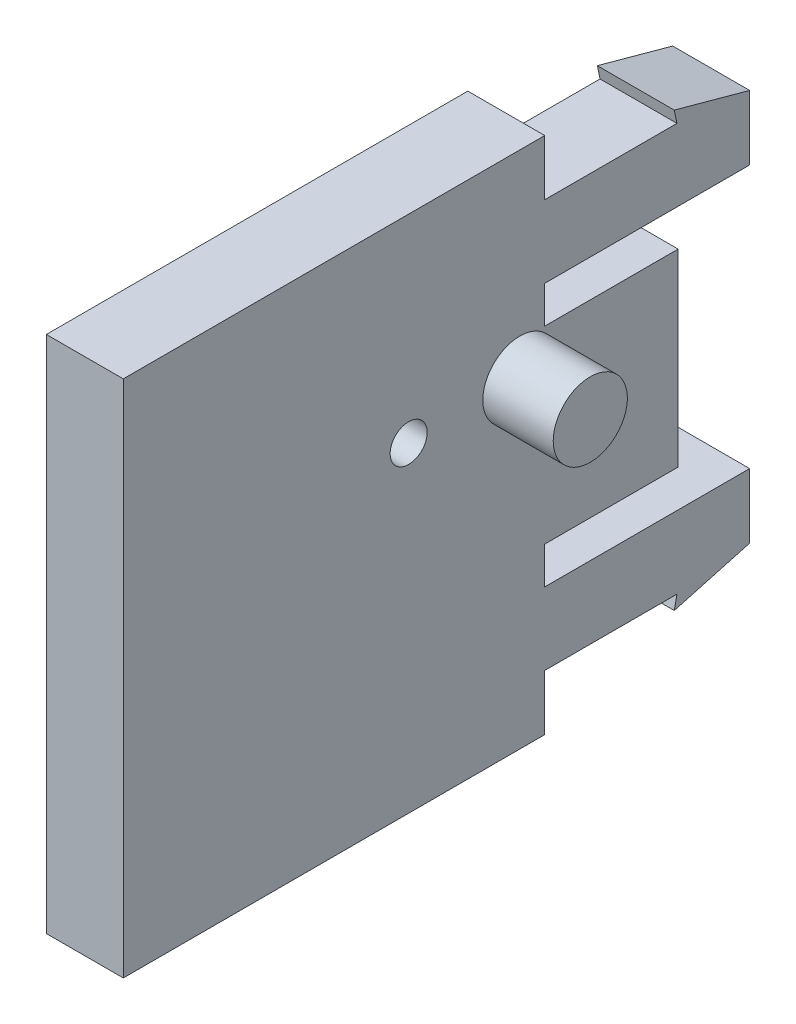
ISO-10303-21;
HEADER;
FILE_DESCRIPTION(('STEP AP214'),'2;1');
FILE_NAME('part.step','',(''),(''),'','','');
FILE_SCHEMA(('AUTOMOTIVE_DESIGN { 1 0 10303 214 1 1 1 1 }'));
ENDSEC;
DATA;
#1=APPLICATION_CONTEXT('core data for automotive mechanical design processes');
#2=APPLICATION_PROTOCOL_DEFINITION('international standard','automotive_design',2000,#1);
#3=PRODUCT_CONTEXT('',#1,'mechanical');
#4=PRODUCT('Part','Part','',(#3));
#5=PRODUCT_RELATED_PRODUCT_CATEGORY('part','',(#4));
#6=PRODUCT_DEFINITION_FORMATION('','',#4);
#7=PRODUCT_DEFINITION_CONTEXT('part definition',#1,'design');
#8=PRODUCT_DEFINITION('design','',#6,#7);
#9=PRODUCT_DEFINITION_SHAPE('','',#8);
#10=(LENGTH_UNIT() NAMED_UNIT(*) SI_UNIT(.MILLI.,.METRE.));
#11=(NAMED_UNIT(*) PLANE_ANGLE_UNIT() SI_UNIT($,.RADIAN.));
#12=(NAMED_UNIT(*) SI_UNIT($,.STERADIAN.) SOLID_ANGLE_UNIT());
#13=UNCERTAINTY_MEASURE_WITH_UNIT(LENGTH_MEASURE(1.E-05),#10,'distance_accuracy_value','');
#14=(GEOMETRIC_REPRESENTATION_CONTEXT(3) GLOBAL_UNCERTAINTY_ASSIGNED_CONTEXT((#13)) GLOBAL_UNIT_ASSIGNED_CONTEXT((#10,
#11,#12)) REPRESENTATION_CONTEXT('',''));
#15=CARTESIAN_POINT('',(0.,0.,0.));
#16=DIRECTION('',(0.,0.,1.));
#17=DIRECTION('',(1.,0.,0.));
#18=AXIS2_PLACEMENT_3D('',#15,#16,#17);
#19=CARTESIAN_POINT('',(5.35307921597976,47.2495708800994,15.));
#20=DIRECTION('',(1.,0.,0.));
#21=DIRECTION('',(0.,0.,-1.));
#22=AXIS2_PLACEMENT_3D('',#19,#20,#21);
#23=PLANE('',#22);
#24=CARTESIAN_POINT('',(5.35307921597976,55.9995709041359,9.1));
#25=DIRECTION('',(-1.,0.,0.));
#26=DIRECTION('',(0.,0.,1.));
#27=AXIS2_PLACEMENT_3D('',#24,#25,#26);
#28=CIRCLE('',#27,0.500000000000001);
#29=CARTESIAN_POINT('',(5.35307921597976,55.9995709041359,9.6));
#30=VERTEX_POINT('',#29);
#31=EDGE_CURVE('E382',#30,#30,#28,.T.);
#32=ORIENTED_EDGE('',*,*,#31,.F.);
#33=EDGE_LOOP('',(#32));
#34=FACE_BOUND('',#33,.T.);
#35=DIRECTION('',(0.,0.,1.));
#36=VECTOR('',#35,1.);
#37=CARTESIAN_POINT('',(5.35307921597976,48.7495708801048,3.62857844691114));
#38=LINE('',#37,#36);
#39=CARTESIAN_POINT('',(5.35307921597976,48.7495708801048,0.0612701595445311));
#40=VERTEX_POINT('',#39);
#41=CARTESIAN_POINT('',(5.35307921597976,48.7495708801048,3.62857844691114));
#42=VERTEX_POINT('',#41);
#43=EDGE_CURVE('E251',#40,#42,#38,.T.);
#44=ORIENTED_EDGE('',*,*,#43,.T.);
#45=DIRECTION('',(0.,-1.,0.));
#46=VECTOR('',#45,1.);
#47=CARTESIAN_POINT('',(5.35307921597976,48.7495708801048,3.62857844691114));
#48=LINE('',#47,#46);
#49=CARTESIAN_POINT('',(5.35307921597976,47.2495708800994,3.62857844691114));
#50=VERTEX_POINT('',#49);
#51=EDGE_CURVE('E174',#42,#50,#48,.T.);
#52=ORIENTED_EDGE('',*,*,#51,.T.);
#53=DIRECTION('',(0.,0.,-1.));
#54=VECTOR('',#53,1.);
#55=CARTESIAN_POINT('',(5.35307921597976,47.2495708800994,15.));
#56=LINE('',#55,#54);
#57=CARTESIAN_POINT('',(5.35307921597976,47.2495708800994,15.));
#58=VERTEX_POINT('',#57);
#59=EDGE_CURVE('E194',#58,#50,#56,.T.);
#60=ORIENTED_EDGE('',*,*,#59,.F.);
#61=DIRECTION('',(0.,-1.,0.));
#62=VECTOR('',#61,1.);
#63=CARTESIAN_POINT('',(5.35307921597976,47.2495708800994,15.));
#64=LINE('',#63,#62);
#65=CARTESIAN_POINT('',(5.35307921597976,61.2495708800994,15.));
#66=VERTEX_POINT('',#65);
#67=EDGE_CURVE('E247',#66,#58,#64,.T.);
#68=ORIENTED_EDGE('',*,*,#67,.F.);
#69=DIRECTION('',(0.,0.,-1.));
#70=VECTOR('',#69,1.);
#71=CARTESIAN_POINT('',(5.35307921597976,61.2495708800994,15.));
#72=LINE('',#71,#70);
#73=CARTESIAN_POINT('',(5.35307921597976,61.2495708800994,3.62857844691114));
#74=VERTEX_POINT('',#73);
#75=EDGE_CURVE('E192',#66,#74,#72,.T.);
#76=ORIENTED_EDGE('',*,*,#75,.T.);
#77=DIRECTION('',(0.,-1.,0.));
#78=VECTOR('',#77,1.);
#79=CARTESIAN_POINT('',(5.35307921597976,59.7495708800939,3.62857844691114));
#80=LINE('',#79,#78);
#81=CARTESIAN_POINT('',(5.35307921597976,59.7495708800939,3.62857844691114));
#82=VERTEX_POINT('',#81);
#83=EDGE_CURVE('E168',#74,#82,#80,.T.);
#84=ORIENTED_EDGE('',*,*,#83,.T.);
#85=DIRECTION('',(0.,0.,-1.));
#86=VECTOR('',#85,1.);
#87=CARTESIAN_POINT('',(5.35307921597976,59.7495708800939,3.62857844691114));
#88=LINE('',#87,#86);
#89=CARTESIAN_POINT('',(5.35307921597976,59.7495708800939,0.0612701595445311));
#90=VERTEX_POINT('',#89);
#91=EDGE_CURVE('E299',#82,#90,#88,.T.);
#92=ORIENTED_EDGE('',*,*,#91,.T.);
#93=DIRECTION('',(0.,0.978799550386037,0.204820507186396));
#94=VECTOR('',#93,1.);
#95=CARTESIAN_POINT('',(5.35307921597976,59.7495708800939,0.0612701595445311));
#96=LINE('',#95,#94);
#97=CARTESIAN_POINT('',(5.35307921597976,60.096272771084,0.133819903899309));
#98=VERTEX_POINT('',#97);
#99=EDGE_CURVE('E302',#90,#98,#96,.T.);
#100=ORIENTED_EDGE('',*,*,#99,.T.);
#101=DIRECTION('',(0.,-0.264145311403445,-0.964482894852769));
#102=VECTOR('',#101,1.);
#103=CARTESIAN_POINT('',(5.35307921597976,60.096272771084,0.133819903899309));
#104=LINE('',#103,#102);
#105=CARTESIAN_POINT('',(5.35307921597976,59.5392654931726,-1.9));
#106=VERTEX_POINT('',#105);
#107=EDGE_CURVE('E309',#98,#106,#104,.T.);
#108=ORIENTED_EDGE('',*,*,#107,.T.);
#109=DIRECTION('',(0.,-1.,0.));
#110=VECTOR('',#109,1.);
#111=CARTESIAN_POINT('',(5.35307921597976,47.2495708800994,-1.9));
#112=LINE('',#111,#110);
#113=CARTESIAN_POINT('',(5.35307921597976,57.796272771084,-1.9));
#114=VERTEX_POINT('',#113);
#115=EDGE_CURVE('E287',#106,#114,#112,.T.);
#116=ORIENTED_EDGE('',*,*,#115,.T.);
#117=DIRECTION('',(0.,0.,1.));
#118=VECTOR('',#117,1.);
#119=CARTESIAN_POINT('',(5.35307921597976,57.796272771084,3.62857844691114));
#120=LINE('',#119,#118);
#121=CARTESIAN_POINT('',(5.35307921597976,57.796272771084,3.62857844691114));
#122=VERTEX_POINT('',#121);
#123=EDGE_CURVE('E312',#114,#122,#120,.T.);
#124=ORIENTED_EDGE('',*,*,#123,.T.);
#125=DIRECTION('',(0.,-1.,0.));
#126=VECTOR('',#125,1.);
#127=CARTESIAN_POINT('',(5.35307921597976,57.796272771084,3.62857844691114));
#128=LINE('',#127,#126);
#129=CARTESIAN_POINT('',(5.35307921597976,56.796272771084,3.62857844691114));
#130=VERTEX_POINT('',#129);
#131=EDGE_CURVE('E315',#122,#130,#128,.T.);
#132=ORIENTED_EDGE('',*,*,#131,.T.);
#133=DIRECTION('',(0.,0.,-1.));
#134=VECTOR('',#133,1.);
#135=CARTESIAN_POINT('',(5.35307921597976,56.796272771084,3.62857844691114));
#136=LINE('',#135,#134);
#137=CARTESIAN_POINT('',(5.35307921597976,56.796272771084,0.0285784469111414));
#138=VERTEX_POINT('',#137);
#139=EDGE_CURVE('E318',#130,#138,#136,.T.);
#140=ORIENTED_EDGE('',*,*,#139,.T.);
#141=DIRECTION('',(0.,-1.,0.));
#142=VECTOR('',#141,1.);
#143=CARTESIAN_POINT('',(5.35307921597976,56.796272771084,0.0285784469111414));
#144=LINE('',#143,#142);
#145=CARTESIAN_POINT('',(5.35307921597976,51.7028689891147,0.0285784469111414));
#146=VERTEX_POINT('',#145);
#147=EDGE_CURVE('E321',#138,#146,#144,.T.);
#148=ORIENTED_EDGE('',*,*,#147,.T.);
#149=DIRECTION('',(0.,0.,1.));
#150=VECTOR('',#149,1.);
#151=CARTESIAN_POINT('',(5.35307921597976,51.7028689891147,3.62857844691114));
#152=LINE('',#151,#150);
#153=CARTESIAN_POINT('',(5.35307921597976,51.7028689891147,3.62857844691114));
#154=VERTEX_POINT('',#153);
#155=EDGE_CURVE('E324',#146,#154,#152,.T.);
#156=ORIENTED_EDGE('',*,*,#155,.T.);
#157=DIRECTION('',(0.,-1.,0.));
#158=VECTOR('',#157,1.);
#159=CARTESIAN_POINT('',(5.35307921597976,50.7028689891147,3.62857844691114));
#160=LINE('',#159,#158);
#161=CARTESIAN_POINT('',(5.35307921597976,50.7028689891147,3.62857844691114));
#162=VERTEX_POINT('',#161);
#163=EDGE_CURVE('E327',#154,#162,#160,.T.);
#164=ORIENTED_EDGE('',*,*,#163,.T.);
#165=DIRECTION('',(0.,0.,-1.));
#166=VECTOR('',#165,1.);
#167=CARTESIAN_POINT('',(5.35307921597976,50.7028689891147,3.62857844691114));
#168=LINE('',#167,#166);
#169=CARTESIAN_POINT('',(5.35307921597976,50.7028689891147,-1.9));
#170=VERTEX_POINT('',#169);
#171=EDGE_CURVE('E330',#162,#170,#168,.T.);
#172=ORIENTED_EDGE('',*,*,#171,.T.);
#173=CARTESIAN_POINT('',(5.35307921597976,48.9598762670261,-1.9));
#174=VERTEX_POINT('',#173);
#175=EDGE_CURVE('E259',#170,#174,#112,.T.);
#176=ORIENTED_EDGE('',*,*,#175,.T.);
#177=DIRECTION('',(0.,-0.264145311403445,0.964482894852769));
#178=VECTOR('',#177,1.);
#179=CARTESIAN_POINT('',(5.35307921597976,48.4028689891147,0.133819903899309));
#180=LINE('',#179,#178);
#181=CARTESIAN_POINT('',(5.35307921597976,48.4028689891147,0.133819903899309));
#182=VERTEX_POINT('',#181);
#183=EDGE_CURVE('E48',#174,#182,#180,.T.);
#184=ORIENTED_EDGE('',*,*,#183,.T.);
#185=DIRECTION('',(0.,0.978799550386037,-0.204820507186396));
#186=VECTOR('',#185,1.);
#187=CARTESIAN_POINT('',(5.35307921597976,48.7495708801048,0.0612701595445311));
#188=LINE('',#187,#186);
#189=EDGE_CURVE('E254',#182,#40,#188,.T.);
#190=ORIENTED_EDGE('',*,*,#189,.T.);
#191=EDGE_LOOP('',(#44,#52,#60,#68,#76,#84,#92,#100,#108,#116,#124,#132,#140,#148,#156,#164,
#172,#176,#184,#190));
#192=FACE_BOUND('',#191,.T.);
#193=CARTESIAN_POINT('',(5.35307921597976,55.9995708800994,12.1));
#194=DIRECTION('',(1.,0.,0.));
#195=DIRECTION('',(0.,0.,-1.));
#196=AXIS2_PLACEMENT_3D('',#193,#194,#195);
#197=CIRCLE('',#196,1.);
#198=CARTESIAN_POINT('',(5.35307921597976,55.9995708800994,11.1));
#199=VERTEX_POINT('',#198);
#200=EDGE_CURVE('E11',#199,#199,#197,.F.);
#201=ORIENTED_EDGE('',*,*,#200,.F.);
#202=EDGE_LOOP('',(#201));
#203=FACE_BOUND('',#202,.T.);
#204=ADVANCED_FACE('F26',(#34,#192,#203),#23,.F.);
#205=CARTESIAN_POINT('',(7.42876299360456,47.2495708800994,15.));
#206=DIRECTION('',(-1.,0.,0.));
#207=DIRECTION('',(0.,0.,1.));
#208=AXIS2_PLACEMENT_3D('',#205,#206,#207);
#209=PLANE('',#208);
#210=CARTESIAN_POINT('',(7.42876299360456,55.8995709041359,7.3));
#211=DIRECTION('',(1.,0.,0.));
#212=DIRECTION('',(0.,0.,-1.));
#213=AXIS2_PLACEMENT_3D('',#210,#211,#212);
#214=CIRCLE('',#213,0.500000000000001);
#215=CARTESIAN_POINT('',(7.42876299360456,55.8995709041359,6.8));
#216=VERTEX_POINT('',#215);
#217=EDGE_CURVE('E388',#216,#216,#214,.T.);
#218=ORIENTED_EDGE('',*,*,#217,.F.);
#219=EDGE_LOOP('',(#218));
#220=FACE_BOUND('',#219,.T.);
#221=DIRECTION('',(0.,0.,-1.));
#222=VECTOR('',#221,1.);
#223=CARTESIAN_POINT('',(7.42876299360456,47.2495708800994,15.));
#224=LINE('',#223,#222);
#225=CARTESIAN_POINT('',(7.42876299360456,47.2495708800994,15.));
#226=VERTEX_POINT('',#225);
#227=CARTESIAN_POINT('',(7.42876299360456,47.2495708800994,3.62857844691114));
#228=VERTEX_POINT('',#227);
#229=EDGE_CURVE('E191',#226,#228,#224,.T.);
#230=ORIENTED_EDGE('',*,*,#229,.T.);
#231=DIRECTION('',(0.,-1.,0.));
#232=VECTOR('',#231,1.);
#233=CARTESIAN_POINT('',(7.42876299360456,48.7495708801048,3.62857844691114));
#234=LINE('',#233,#232);
#235=CARTESIAN_POINT('',(7.42876299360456,48.7495708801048,3.62857844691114));
#236=VERTEX_POINT('',#235);
#237=EDGE_CURVE('E300',#236,#228,#234,.T.);
#238=ORIENTED_EDGE('',*,*,#237,.F.);
#239=DIRECTION('',(0.,0.,1.));
#240=VECTOR('',#239,1.);
#241=CARTESIAN_POINT('',(7.42876299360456,48.7495708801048,3.62857844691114));
#242=LINE('',#241,#240);
#243=CARTESIAN_POINT('',(7.42876299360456,48.7495708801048,0.0612701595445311));
#244=VERTEX_POINT('',#243);
#245=EDGE_CURVE('E304',#244,#236,#242,.T.);
#246=ORIENTED_EDGE('',*,*,#245,.F.);
#247=DIRECTION('',(0.,0.978799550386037,-0.204820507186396));
#248=VECTOR('',#247,1.);
#249=CARTESIAN_POINT('',(7.42876299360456,48.7495708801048,0.0612701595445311));
#250=LINE('',#249,#248);
#251=CARTESIAN_POINT('',(7.42876299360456,48.4028689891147,0.133819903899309));
#252=VERTEX_POINT('',#251);
#253=EDGE_CURVE('E338',#252,#244,#250,.T.);
#254=ORIENTED_EDGE('',*,*,#253,.F.);
#255=DIRECTION('',(0.,-0.264145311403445,0.964482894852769));
#256=VECTOR('',#255,1.);
#257=CARTESIAN_POINT('',(7.42876299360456,48.4028689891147,0.133819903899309));
#258=LINE('',#257,#256);
#259=CARTESIAN_POINT('',(7.42876299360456,48.9598762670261,-1.9));
#260=VERTEX_POINT('',#259);
#261=EDGE_CURVE('E346',#260,#252,#258,.T.);
#262=ORIENTED_EDGE('',*,*,#261,.F.);
#263=DIRECTION('',(0.,1.,0.));
#264=VECTOR('',#263,1.);
#265=CARTESIAN_POINT('',(7.42876299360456,47.2495708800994,-1.9));
#266=LINE('',#265,#264);
#267=CARTESIAN_POINT('',(7.42876299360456,50.7028689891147,-1.9));
#268=VERTEX_POINT('',#267);
#269=EDGE_CURVE('E291',#260,#268,#266,.T.);
#270=ORIENTED_EDGE('',*,*,#269,.T.);
#271=DIRECTION('',(0.,0.,-1.));
#272=VECTOR('',#271,1.);
#273=CARTESIAN_POINT('',(7.42876299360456,50.7028689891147,3.62857844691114));
#274=LINE('',#273,#272);
#275=CARTESIAN_POINT('',(7.42876299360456,50.7028689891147,3.62857844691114));
#276=VERTEX_POINT('',#275);
#277=EDGE_CURVE('E350',#276,#268,#274,.T.);
#278=ORIENTED_EDGE('',*,*,#277,.F.);
#279=DIRECTION('',(0.,-1.,0.));
#280=VECTOR('',#279,1.);
#281=CARTESIAN_POINT('',(7.42876299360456,50.7028689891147,3.62857844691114));
#282=LINE('',#281,#280);
#283=CARTESIAN_POINT('',(7.42876299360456,51.7028689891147,3.62857844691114));
#284=VERTEX_POINT('',#283);
#285=EDGE_CURVE('E352',#284,#276,#282,.T.);
#286=ORIENTED_EDGE('',*,*,#285,.F.);
#287=DIRECTION('',(0.,0.,1.));
#288=VECTOR('',#287,1.);
#289=CARTESIAN_POINT('',(7.42876299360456,51.7028689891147,3.62857844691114));
#290=LINE('',#289,#288);
#291=CARTESIAN_POINT('',(7.42876299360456,51.7028689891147,0.0285784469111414));
#292=VERTEX_POINT('',#291);
#293=EDGE_CURVE('E355',#292,#284,#290,.T.);
#294=ORIENTED_EDGE('',*,*,#293,.F.);
#295=DIRECTION('',(0.,-1.,0.));
#296=VECTOR('',#295,1.);
#297=CARTESIAN_POINT('',(7.42876299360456,56.796272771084,0.0285784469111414));
#298=LINE('',#297,#296);
#299=CARTESIAN_POINT('',(7.42876299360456,56.796272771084,0.0285784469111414));
#300=VERTEX_POINT('',#299);
#301=EDGE_CURVE('E358',#300,#292,#298,.T.);
#302=ORIENTED_EDGE('',*,*,#301,.F.);
#303=DIRECTION('',(0.,0.,-1.));
#304=VECTOR('',#303,1.);
#305=CARTESIAN_POINT('',(7.42876299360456,56.796272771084,3.62857844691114));
#306=LINE('',#305,#304);
#307=CARTESIAN_POINT('',(7.42876299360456,56.796272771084,3.62857844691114));
#308=VERTEX_POINT('',#307);
#309=EDGE_CURVE('E361',#308,#300,#306,.T.);
#310=ORIENTED_EDGE('',*,*,#309,.F.);
#311=DIRECTION('',(0.,-1.,0.));
#312=VECTOR('',#311,1.);
#313=CARTESIAN_POINT('',(7.42876299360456,57.796272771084,3.62857844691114));
#314=LINE('',#313,#312);
#315=CARTESIAN_POINT('',(7.42876299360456,57.796272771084,3.62857844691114));
#316=VERTEX_POINT('',#315);
#317=EDGE_CURVE('E364',#316,#308,#314,.T.);
#318=ORIENTED_EDGE('',*,*,#317,.F.);
#319=DIRECTION('',(0.,0.,1.));
#320=VECTOR('',#319,1.);
#321=CARTESIAN_POINT('',(7.42876299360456,57.796272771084,3.62857844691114));
#322=LINE('',#321,#320);
#323=CARTESIAN_POINT('',(7.42876299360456,57.796272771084,-1.9));
#324=VERTEX_POINT('',#323);
#325=EDGE_CURVE('E367',#324,#316,#322,.T.);
#326=ORIENTED_EDGE('',*,*,#325,.F.);
#327=CARTESIAN_POINT('',(7.42876299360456,59.5392654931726,-1.9));
#328=VERTEX_POINT('',#327);
#329=EDGE_CURVE('E288',#324,#328,#266,.T.);
#330=ORIENTED_EDGE('',*,*,#329,.T.);
#331=DIRECTION('',(0.,-0.264145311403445,-0.964482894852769));
#332=VECTOR('',#331,1.);
#333=CARTESIAN_POINT('',(7.42876299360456,60.096272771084,0.133819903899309));
#334=LINE('',#333,#332);
#335=CARTESIAN_POINT('',(7.42876299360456,60.096272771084,0.133819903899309));
#336=VERTEX_POINT('',#335);
#337=EDGE_CURVE('E40',#336,#328,#334,.T.);
#338=ORIENTED_EDGE('',*,*,#337,.F.);
#339=DIRECTION('',(0.,0.978799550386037,0.204820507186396));
#340=VECTOR('',#339,1.);
#341=CARTESIAN_POINT('',(7.42876299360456,59.7495708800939,0.0612701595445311));
#342=LINE('',#341,#340);
#343=CARTESIAN_POINT('',(7.42876299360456,59.7495708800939,0.0612701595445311));
#344=VERTEX_POINT('',#343);
#345=EDGE_CURVE('E370',#344,#336,#342,.T.);
#346=ORIENTED_EDGE('',*,*,#345,.F.);
#347=DIRECTION('',(0.,0.,-1.));
#348=VECTOR('',#347,1.);
#349=CARTESIAN_POINT('',(7.42876299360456,59.7495708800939,3.62857844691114));
#350=LINE('',#349,#348);
#351=CARTESIAN_POINT('',(7.42876299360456,59.7495708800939,3.62857844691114));
#352=VERTEX_POINT('',#351);
#353=EDGE_CURVE('E186',#352,#344,#350,.T.);
#354=ORIENTED_EDGE('',*,*,#353,.F.);
#355=DIRECTION('',(0.,-1.,0.));
#356=VECTOR('',#355,1.);
#357=CARTESIAN_POINT('',(7.42876299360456,59.7495708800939,3.62857844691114));
#358=LINE('',#357,#356);
#359=CARTESIAN_POINT('',(7.42876299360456,61.2495708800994,3.62857844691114));
#360=VERTEX_POINT('',#359);
#361=EDGE_CURVE('E165',#360,#352,#358,.T.);
#362=ORIENTED_EDGE('',*,*,#361,.F.);
#363=DIRECTION('',(0.,0.,-1.));
#364=VECTOR('',#363,1.);
#365=CARTESIAN_POINT('',(7.42876299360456,61.2495708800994,15.));
#366=LINE('',#365,#364);
#367=CARTESIAN_POINT('',(7.42876299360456,61.2495708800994,15.));
#368=VERTEX_POINT('',#367);
#369=EDGE_CURVE('E182',#368,#360,#366,.T.);
#370=ORIENTED_EDGE('',*,*,#369,.F.);
#371=DIRECTION('',(0.,1.,0.));
#372=VECTOR('',#371,1.);
#373=CARTESIAN_POINT('',(7.42876299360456,47.2495708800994,15.));
#374=LINE('',#373,#372);
#375=EDGE_CURVE('E294',#226,#368,#374,.T.);
#376=ORIENTED_EDGE('',*,*,#375,.F.);
#377=EDGE_LOOP('',(#230,#238,#246,#254,#262,#270,#278,#286,#294,#302,#310,#318,#326,#330,#338,
#346,#354,#362,#370,#376));
#378=FACE_BOUND('',#377,.T.);
#379=CARTESIAN_POINT('',(7.42876299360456,55.8995708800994,4.3));
#380=DIRECTION('',(-1.,0.,0.));
#381=DIRECTION('',(0.,0.,1.));
#382=AXIS2_PLACEMENT_3D('',#379,#380,#381);
#383=CIRCLE('',#382,1.);
#384=CARTESIAN_POINT('',(7.42876299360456,55.8995708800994,5.3));
#385=VERTEX_POINT('',#384);
#386=EDGE_CURVE('E33',#385,#385,#383,.F.);
#387=ORIENTED_EDGE('',*,*,#386,.F.);
#388=EDGE_LOOP('',(#387));
#389=FACE_BOUND('',#388,.T.);
#390=ADVANCED_FACE('F179',(#220,#378,#389),#209,.F.);
#391=CARTESIAN_POINT('',(5.35307921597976,61.2495708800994,-1.9));
#392=DIRECTION('',(0.,0.,-1.));
#393=DIRECTION('',(-1.,0.,0.));
#394=AXIS2_PLACEMENT_3D('',#391,#392,#393);
#395=PLANE('',#394);
#396=DIRECTION('',(1.,0.,0.));
#397=VECTOR('',#396,1.);
#398=CARTESIAN_POINT('',(5.35307921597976,48.9598762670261,-1.9));
#399=LINE('',#398,#397);
#400=EDGE_CURVE('E207',#174,#260,#399,.T.);
#401=ORIENTED_EDGE('',*,*,#400,.F.);
#402=ORIENTED_EDGE('',*,*,#175,.F.);
#403=DIRECTION('',(-1.,0.,0.));
#404=VECTOR('',#403,1.);
#405=CARTESIAN_POINT('',(5.35307921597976,50.7028689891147,-1.9));
#406=LINE('',#405,#404);
#407=EDGE_CURVE('E205',#268,#170,#406,.T.);
#408=ORIENTED_EDGE('',*,*,#407,.F.);
#409=ORIENTED_EDGE('',*,*,#269,.F.);
#410=EDGE_LOOP('',(#401,#402,#408,#409));
#411=FACE_BOUND('',#410,.T.);
#412=ADVANCED_FACE('F213',(#411),#395,.T.);
#413=CARTESIAN_POINT('',(5.35307921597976,47.2495708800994,15.));
#414=DIRECTION('',(0.,1.,0.));
#415=DIRECTION('',(0.,0.,1.));
#416=AXIS2_PLACEMENT_3D('',#413,#414,#415);
#417=PLANE('',#416);
#418=ORIENTED_EDGE('',*,*,#59,.T.);
#419=DIRECTION('',(1.,0.,0.));
#420=VECTOR('',#419,1.);
#421=CARTESIAN_POINT('',(5.35307921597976,47.2495708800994,3.62857844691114));
#422=LINE('',#421,#420);
#423=EDGE_CURVE('E239',#50,#228,#422,.T.);
#424=ORIENTED_EDGE('',*,*,#423,.T.);
#425=ORIENTED_EDGE('',*,*,#229,.F.);
#426=DIRECTION('',(1.,0.,0.));
#427=VECTOR('',#426,1.);
#428=CARTESIAN_POINT('',(5.35307921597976,47.2495708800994,15.));
#429=LINE('',#428,#427);
#430=EDGE_CURVE('E240',#58,#226,#429,.T.);
#431=ORIENTED_EDGE('',*,*,#430,.F.);
#432=EDGE_LOOP('',(#418,#424,#425,#431));
#433=FACE_BOUND('',#432,.T.);
#434=ADVANCED_FACE('F221',(#433),#417,.F.);
#435=CARTESIAN_POINT('',(5.35307921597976,61.2495708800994,15.));
#436=DIRECTION('',(0.,-1.,0.));
#437=DIRECTION('',(0.,0.,-1.));
#438=AXIS2_PLACEMENT_3D('',#435,#436,#437);
#439=PLANE('',#438);
#440=ORIENTED_EDGE('',*,*,#369,.T.);
#441=DIRECTION('',(1.,0.,0.));
#442=VECTOR('',#441,1.);
#443=CARTESIAN_POINT('',(5.35307921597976,61.2495708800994,3.62857844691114));
#444=LINE('',#443,#442);
#445=EDGE_CURVE('E162',#74,#360,#444,.T.);
#446=ORIENTED_EDGE('',*,*,#445,.F.);
#447=ORIENTED_EDGE('',*,*,#75,.F.);
#448=DIRECTION('',(-1.,0.,0.));
#449=VECTOR('',#448,1.);
#450=CARTESIAN_POINT('',(5.35307921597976,61.2495708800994,15.));
#451=LINE('',#450,#449);
#452=EDGE_CURVE('E190',#368,#66,#451,.T.);
#453=ORIENTED_EDGE('',*,*,#452,.F.);
#454=EDGE_LOOP('',(#440,#446,#447,#453));
#455=FACE_BOUND('',#454,.T.);
#456=ADVANCED_FACE('F189',(#455),#439,.F.);
#457=CARTESIAN_POINT('',(5.35307921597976,61.2495708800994,15.));
#458=DIRECTION('',(0.,0.,-1.));
#459=DIRECTION('',(-1.,0.,0.));
#460=AXIS2_PLACEMENT_3D('',#457,#458,#459);
#461=PLANE('',#460);
#462=ORIENTED_EDGE('',*,*,#67,.T.);
#463=ORIENTED_EDGE('',*,*,#430,.T.);
#464=ORIENTED_EDGE('',*,*,#375,.T.);
#465=ORIENTED_EDGE('',*,*,#452,.T.);
#466=EDGE_LOOP('',(#462,#463,#464,#465));
#467=FACE_BOUND('',#466,.T.);
#468=ADVANCED_FACE('F235',(#467),#461,.F.);
#469=DIRECTION('',(1.,0.,0.));
#470=VECTOR('',#469,1.);
#471=CARTESIAN_POINT('',(5.35307921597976,57.796272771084,-1.9));
#472=LINE('',#471,#470);
#473=EDGE_CURVE('E203',#114,#324,#472,.T.);
#474=ORIENTED_EDGE('',*,*,#473,.F.);
#475=ORIENTED_EDGE('',*,*,#115,.F.);
#476=DIRECTION('',(-1.,0.,0.));
#477=VECTOR('',#476,1.);
#478=CARTESIAN_POINT('',(5.35307921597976,59.5392654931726,-1.9));
#479=LINE('',#478,#477);
#480=EDGE_CURVE('E201',#328,#106,#479,.T.);
#481=ORIENTED_EDGE('',*,*,#480,.F.);
#482=ORIENTED_EDGE('',*,*,#329,.F.);
#483=EDGE_LOOP('',(#474,#475,#481,#482));
#484=FACE_BOUND('',#483,.T.);
#485=ADVANCED_FACE('F224',(#484),#395,.T.);
#486=CARTESIAN_POINT('',(5.35307921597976,60.096272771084,0.133819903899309));
#487=DIRECTION('',(0.,-0.964482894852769,0.264145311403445));
#488=DIRECTION('',(0.,-0.264145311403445,-0.964482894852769));
#489=AXIS2_PLACEMENT_3D('',#486,#487,#488);
#490=PLANE('',#489);
#491=ORIENTED_EDGE('',*,*,#480,.T.);
#492=ORIENTED_EDGE('',*,*,#107,.F.);
#493=DIRECTION('',(1.,0.,0.));
#494=VECTOR('',#493,1.);
#495=CARTESIAN_POINT('',(5.35307921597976,60.096272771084,0.133819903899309));
#496=LINE('',#495,#494);
#497=EDGE_CURVE('E280',#98,#336,#496,.T.);
#498=ORIENTED_EDGE('',*,*,#497,.T.);
#499=ORIENTED_EDGE('',*,*,#337,.T.);
#500=EDGE_LOOP('',(#491,#492,#498,#499));
#501=FACE_BOUND('',#500,.T.);
#502=ADVANCED_FACE('F462',(#501),#490,.F.);
#503=CARTESIAN_POINT('',(5.35307921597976,59.7495708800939,3.62857844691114));
#504=DIRECTION('',(0.,0.,1.));
#505=DIRECTION('',(1.,0.,0.));
#506=AXIS2_PLACEMENT_3D('',#503,#504,#505);
#507=PLANE('',#506);
#508=ORIENTED_EDGE('',*,*,#361,.T.);
#509=DIRECTION('',(1.,0.,0.));
#510=VECTOR('',#509,1.);
#511=CARTESIAN_POINT('',(5.35307921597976,59.7495708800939,3.62857844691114));
#512=LINE('',#511,#510);
#513=EDGE_CURVE('E173',#82,#352,#512,.T.);
#514=ORIENTED_EDGE('',*,*,#513,.F.);
#515=ORIENTED_EDGE('',*,*,#83,.F.);
#516=ORIENTED_EDGE('',*,*,#445,.T.);
#517=EDGE_LOOP('',(#508,#514,#515,#516));
#518=FACE_BOUND('',#517,.T.);
#519=ADVANCED_FACE('F164',(#518),#507,.F.);
#520=CARTESIAN_POINT('',(5.35307921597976,59.7495708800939,3.62857844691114));
#521=DIRECTION('',(0.,-1.,0.));
#522=DIRECTION('',(0.,0.,-1.));
#523=AXIS2_PLACEMENT_3D('',#520,#521,#522);
#524=PLANE('',#523);
#525=ORIENTED_EDGE('',*,*,#353,.T.);
#526=DIRECTION('',(1.,0.,0.));
#527=VECTOR('',#526,1.);
#528=CARTESIAN_POINT('',(5.35307921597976,59.7495708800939,0.0612701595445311));
#529=LINE('',#528,#527);
#530=EDGE_CURVE('E282',#90,#344,#529,.T.);
#531=ORIENTED_EDGE('',*,*,#530,.F.);
#532=ORIENTED_EDGE('',*,*,#91,.F.);
#533=ORIENTED_EDGE('',*,*,#513,.T.);
#534=EDGE_LOOP('',(#525,#531,#532,#533));
#535=FACE_BOUND('',#534,.T.);
#536=ADVANCED_FACE('F467',(#535),#524,.F.);
#537=CARTESIAN_POINT('',(5.35307921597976,59.7495708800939,0.0612701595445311));
#538=DIRECTION('',(0.,0.204820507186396,-0.978799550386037));
#539=DIRECTION('',(0.,0.978799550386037,0.204820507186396));
#540=AXIS2_PLACEMENT_3D('',#537,#538,#539);
#541=PLANE('',#540);
#542=ORIENTED_EDGE('',*,*,#345,.T.);
#543=ORIENTED_EDGE('',*,*,#497,.F.);
#544=ORIENTED_EDGE('',*,*,#99,.F.);
#545=ORIENTED_EDGE('',*,*,#530,.T.);
#546=EDGE_LOOP('',(#542,#543,#544,#545));
#547=FACE_BOUND('',#546,.T.);
#548=ADVANCED_FACE('F438',(#547),#541,.F.);
#549=CARTESIAN_POINT('',(5.35307921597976,50.7028689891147,3.62857844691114));
#550=DIRECTION('',(0.,-1.,0.));
#551=DIRECTION('',(0.,0.,-1.));
#552=AXIS2_PLACEMENT_3D('',#549,#550,#551);
#553=PLANE('',#552);
#554=ORIENTED_EDGE('',*,*,#407,.T.);
#555=ORIENTED_EDGE('',*,*,#171,.F.);
#556=DIRECTION('',(1.,0.,0.));
#557=VECTOR('',#556,1.);
#558=CARTESIAN_POINT('',(5.35307921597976,50.7028689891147,3.62857844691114));
#559=LINE('',#558,#557);
#560=EDGE_CURVE('E267',#162,#276,#559,.T.);
#561=ORIENTED_EDGE('',*,*,#560,.T.);
#562=ORIENTED_EDGE('',*,*,#277,.T.);
#563=EDGE_LOOP('',(#554,#555,#561,#562));
#564=FACE_BOUND('',#563,.T.);
#565=ADVANCED_FACE('F434',(#564),#553,.F.);
#566=CARTESIAN_POINT('',(5.35307921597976,57.796272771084,3.62857844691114));
#567=DIRECTION('',(0.,1.,0.));
#568=DIRECTION('',(0.,0.,1.));
#569=AXIS2_PLACEMENT_3D('',#566,#567,#568);
#570=PLANE('',#569);
#571=ORIENTED_EDGE('',*,*,#473,.T.);
#572=ORIENTED_EDGE('',*,*,#325,.T.);
#573=DIRECTION('',(1.,0.,0.));
#574=VECTOR('',#573,1.);
#575=CARTESIAN_POINT('',(5.35307921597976,57.796272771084,3.62857844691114));
#576=LINE('',#575,#574);
#577=EDGE_CURVE('E277',#122,#316,#576,.T.);
#578=ORIENTED_EDGE('',*,*,#577,.F.);
#579=ORIENTED_EDGE('',*,*,#123,.F.);
#580=EDGE_LOOP('',(#571,#572,#578,#579));
#581=FACE_BOUND('',#580,.T.);
#582=ADVANCED_FACE('F437',(#581),#570,.F.);
#583=CARTESIAN_POINT('',(5.35307921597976,57.796272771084,3.62857844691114));
#584=DIRECTION('',(0.,0.,1.));
#585=DIRECTION('',(1.,0.,0.));
#586=AXIS2_PLACEMENT_3D('',#583,#584,#585);
#587=PLANE('',#586);
#588=ORIENTED_EDGE('',*,*,#317,.T.);
#589=DIRECTION('',(1.,0.,0.));
#590=VECTOR('',#589,1.);
#591=CARTESIAN_POINT('',(5.35307921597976,56.796272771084,3.62857844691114));
#592=LINE('',#591,#590);
#593=EDGE_CURVE('E275',#130,#308,#592,.T.);
#594=ORIENTED_EDGE('',*,*,#593,.F.);
#595=ORIENTED_EDGE('',*,*,#131,.F.);
#596=ORIENTED_EDGE('',*,*,#577,.T.);
#597=EDGE_LOOP('',(#588,#594,#595,#596));
#598=FACE_BOUND('',#597,.T.);
#599=ADVANCED_FACE('F454',(#598),#587,.F.);
#600=CARTESIAN_POINT('',(5.35307921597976,56.796272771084,3.62857844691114));
#601=DIRECTION('',(0.,-1.,0.));
#602=DIRECTION('',(0.,0.,-1.));
#603=AXIS2_PLACEMENT_3D('',#600,#601,#602);
#604=PLANE('',#603);
#605=ORIENTED_EDGE('',*,*,#309,.T.);
#606=DIRECTION('',(1.,0.,0.));
#607=VECTOR('',#606,1.);
#608=CARTESIAN_POINT('',(5.35307921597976,56.796272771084,0.0285784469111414));
#609=LINE('',#608,#607);
#610=EDGE_CURVE('E273',#138,#300,#609,.T.);
#611=ORIENTED_EDGE('',*,*,#610,.F.);
#612=ORIENTED_EDGE('',*,*,#139,.F.);
#613=ORIENTED_EDGE('',*,*,#593,.T.);
#614=EDGE_LOOP('',(#605,#611,#612,#613));
#615=FACE_BOUND('',#614,.T.);
#616=ADVANCED_FACE('F450',(#615),#604,.F.);
#617=CARTESIAN_POINT('',(5.35307921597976,56.796272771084,0.0285784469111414));
#618=DIRECTION('',(0.,0.,1.));
#619=DIRECTION('',(1.,0.,0.));
#620=AXIS2_PLACEMENT_3D('',#617,#618,#619);
#621=PLANE('',#620);
#622=ORIENTED_EDGE('',*,*,#301,.T.);
#623=DIRECTION('',(1.,0.,0.));
#624=VECTOR('',#623,1.);
#625=CARTESIAN_POINT('',(5.35307921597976,51.7028689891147,0.0285784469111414));
#626=LINE('',#625,#624);
#627=EDGE_CURVE('E271',#146,#292,#626,.T.);
#628=ORIENTED_EDGE('',*,*,#627,.F.);
#629=ORIENTED_EDGE('',*,*,#147,.F.);
#630=ORIENTED_EDGE('',*,*,#610,.T.);
#631=EDGE_LOOP('',(#622,#628,#629,#630));
#632=FACE_BOUND('',#631,.T.);
#633=ADVANCED_FACE('F446',(#632),#621,.F.);
#634=CARTESIAN_POINT('',(5.35307921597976,51.7028689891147,3.62857844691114));
#635=DIRECTION('',(0.,1.,0.));
#636=DIRECTION('',(0.,0.,1.));
#637=AXIS2_PLACEMENT_3D('',#634,#635,#636);
#638=PLANE('',#637);
#639=ORIENTED_EDGE('',*,*,#293,.T.);
#640=DIRECTION('',(1.,0.,0.));
#641=VECTOR('',#640,1.);
#642=CARTESIAN_POINT('',(5.35307921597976,51.7028689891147,3.62857844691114));
#643=LINE('',#642,#641);
#644=EDGE_CURVE('E269',#154,#284,#643,.T.);
#645=ORIENTED_EDGE('',*,*,#644,.F.);
#646=ORIENTED_EDGE('',*,*,#155,.F.);
#647=ORIENTED_EDGE('',*,*,#627,.T.);
#648=EDGE_LOOP('',(#639,#645,#646,#647));
#649=FACE_BOUND('',#648,.T.);
#650=ADVANCED_FACE('F442',(#649),#638,.F.);
#651=CARTESIAN_POINT('',(5.35307921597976,50.7028689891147,3.62857844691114));
#652=DIRECTION('',(0.,0.,1.));
#653=DIRECTION('',(1.,0.,0.));
#654=AXIS2_PLACEMENT_3D('',#651,#652,#653);
#655=PLANE('',#654);
#656=ORIENTED_EDGE('',*,*,#285,.T.);
#657=ORIENTED_EDGE('',*,*,#560,.F.);
#658=ORIENTED_EDGE('',*,*,#163,.F.);
#659=ORIENTED_EDGE('',*,*,#644,.T.);
#660=EDGE_LOOP('',(#656,#657,#658,#659));
#661=FACE_BOUND('',#660,.T.);
#662=ADVANCED_FACE('F427',(#661),#655,.F.);
#663=CARTESIAN_POINT('',(5.35307921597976,48.7495708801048,3.62857844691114));
#664=DIRECTION('',(0.,0.,1.));
#665=DIRECTION('',(1.,0.,0.));
#666=AXIS2_PLACEMENT_3D('',#663,#664,#665);
#667=PLANE('',#666);
#668=ORIENTED_EDGE('',*,*,#237,.T.);
#669=ORIENTED_EDGE('',*,*,#423,.F.);
#670=ORIENTED_EDGE('',*,*,#51,.F.);
#671=DIRECTION('',(1.,0.,0.));
#672=VECTOR('',#671,1.);
#673=CARTESIAN_POINT('',(5.35307921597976,48.7495708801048,3.62857844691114));
#674=LINE('',#673,#672);
#675=EDGE_CURVE('E260',#42,#236,#674,.T.);
#676=ORIENTED_EDGE('',*,*,#675,.T.);
#677=EDGE_LOOP('',(#668,#669,#670,#676));
#678=FACE_BOUND('',#677,.T.);
#679=ADVANCED_FACE('F344',(#678),#667,.F.);
#680=CARTESIAN_POINT('',(5.35307921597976,48.7495708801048,3.62857844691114));
#681=DIRECTION('',(0.,1.,0.));
#682=DIRECTION('',(0.,0.,1.));
#683=AXIS2_PLACEMENT_3D('',#680,#681,#682);
#684=PLANE('',#683);
#685=ORIENTED_EDGE('',*,*,#245,.T.);
#686=ORIENTED_EDGE('',*,*,#675,.F.);
#687=ORIENTED_EDGE('',*,*,#43,.F.);
#688=DIRECTION('',(1.,0.,0.));
#689=VECTOR('',#688,1.);
#690=CARTESIAN_POINT('',(5.35307921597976,48.7495708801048,0.0612701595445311));
#691=LINE('',#690,#689);
#692=EDGE_CURVE('E262',#40,#244,#691,.T.);
#693=ORIENTED_EDGE('',*,*,#692,.T.);
#694=EDGE_LOOP('',(#685,#686,#687,#693));
#695=FACE_BOUND('',#694,.T.);
#696=ADVANCED_FACE('F342',(#695),#684,.F.);
#697=CARTESIAN_POINT('',(5.35307921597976,48.7495708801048,0.0612701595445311));
#698=DIRECTION('',(0.,-0.204820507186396,-0.978799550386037));
#699=DIRECTION('',(0.,0.978799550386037,-0.204820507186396));
#700=AXIS2_PLACEMENT_3D('',#697,#698,#699);
#701=PLANE('',#700);
#702=ORIENTED_EDGE('',*,*,#253,.T.);
#703=ORIENTED_EDGE('',*,*,#692,.F.);
#704=ORIENTED_EDGE('',*,*,#189,.F.);
#705=DIRECTION('',(1.,0.,0.));
#706=VECTOR('',#705,1.);
#707=CARTESIAN_POINT('',(5.35307921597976,48.4028689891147,0.133819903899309));
#708=LINE('',#707,#706);
#709=EDGE_CURVE('E264',#182,#252,#708,.T.);
#710=ORIENTED_EDGE('',*,*,#709,.T.);
#711=EDGE_LOOP('',(#702,#703,#704,#710));
#712=FACE_BOUND('',#711,.T.);
#713=ADVANCED_FACE('F336',(#712),#701,.F.);
#714=CARTESIAN_POINT('',(5.35307921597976,48.4028689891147,0.133819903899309));
#715=DIRECTION('',(0.,0.964482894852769,0.264145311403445));
#716=DIRECTION('',(0.,-0.264145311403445,0.964482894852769));
#717=AXIS2_PLACEMENT_3D('',#714,#715,#716);
#718=PLANE('',#717);
#719=ORIENTED_EDGE('',*,*,#400,.T.);
#720=ORIENTED_EDGE('',*,*,#261,.T.);
#721=ORIENTED_EDGE('',*,*,#709,.F.);
#722=ORIENTED_EDGE('',*,*,#183,.F.);
#723=EDGE_LOOP('',(#719,#720,#721,#722));
#724=FACE_BOUND('',#723,.T.);
#725=ADVANCED_FACE('F423',(#724),#718,.F.);
#726=CARTESIAN_POINT('',(9.32876299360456,55.8995708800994,4.3));
#727=DIRECTION('',(-1.,0.,0.));
#728=DIRECTION('',(0.,0.,1.));
#729=AXIS2_PLACEMENT_3D('',#726,#727,#728);
#730=CYLINDRICAL_SURFACE('',#729,1.);
#731=CARTESIAN_POINT('',(9.32876299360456,55.8995708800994,4.3));
#732=DIRECTION('',(1.,0.,0.));
#733=DIRECTION('',(0.,0.,-1.));
#734=AXIS2_PLACEMENT_3D('',#731,#732,#733);
#735=CIRCLE('',#734,1.);
#736=CARTESIAN_POINT('',(9.32876299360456,55.8995708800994,5.3));
#737=VERTEX_POINT('',#736);
#738=EDGE_CURVE('E187',#737,#737,#735,.T.);
#739=CARTESIAN_POINT('',(9.32876299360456,55.8995708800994,5.3));
#740=CARTESIAN_POINT('',(9.30897132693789,55.8995708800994,5.3));
#741=CARTESIAN_POINT('',(9.28917966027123,55.8995708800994,5.3));
#742=CARTESIAN_POINT('',(9.24959632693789,55.8995708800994,5.3));
#743=CARTESIAN_POINT('',(9.22980466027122,55.8995708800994,5.3));
#744=CARTESIAN_POINT('',(9.19022132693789,55.8995708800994,5.3));
#745=CARTESIAN_POINT('',(9.17042966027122,55.8995708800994,5.3));
#746=CARTESIAN_POINT('',(9.13084632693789,55.8995708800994,5.3));
#747=CARTESIAN_POINT('',(9.11105466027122,55.8995708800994,5.3));
#748=CARTESIAN_POINT('',(9.07147132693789,55.8995708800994,5.3));
#749=CARTESIAN_POINT('',(9.05167966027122,55.8995708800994,5.3));
#750=CARTESIAN_POINT('',(9.01209632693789,55.8995708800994,5.3));
#751=CARTESIAN_POINT('',(8.99230466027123,55.8995708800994,5.3));
#752=CARTESIAN_POINT('',(8.95272132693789,55.8995708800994,5.3));
#753=CARTESIAN_POINT('',(8.93292966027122,55.8995708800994,5.3));
#754=CARTESIAN_POINT('',(8.89334632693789,55.8995708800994,5.3));
#755=CARTESIAN_POINT('',(8.87355466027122,55.8995708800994,5.3));
#756=CARTESIAN_POINT('',(8.83397132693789,55.8995708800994,5.3));
#757=CARTESIAN_POINT('',(8.81417966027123,55.8995708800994,5.3));
#758=CARTESIAN_POINT('',(8.77459632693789,55.8995708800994,5.3));
#759=CARTESIAN_POINT('',(8.75480466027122,55.8995708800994,5.3));
#760=CARTESIAN_POINT('',(8.71522132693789,55.8995708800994,5.3));
#761=CARTESIAN_POINT('',(8.69542966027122,55.8995708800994,5.3));
#762=CARTESIAN_POINT('',(8.65584632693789,55.8995708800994,5.3));
#763=CARTESIAN_POINT('',(8.63605466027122,55.8995708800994,5.3));
#764=CARTESIAN_POINT('',(8.59647132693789,55.8995708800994,5.3));
#765=CARTESIAN_POINT('',(8.57667966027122,55.8995708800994,5.3));
#766=CARTESIAN_POINT('',(8.53709632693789,55.8995708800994,5.3));
#767=CARTESIAN_POINT('',(8.51730466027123,55.8995708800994,5.3));
#768=CARTESIAN_POINT('',(8.47772132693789,55.8995708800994,5.3));
#769=CARTESIAN_POINT('',(8.45792966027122,55.8995708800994,5.3));
#770=CARTESIAN_POINT('',(8.41834632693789,55.8995708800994,5.3));
#771=CARTESIAN_POINT('',(8.39855466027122,55.8995708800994,5.3));
#772=CARTESIAN_POINT('',(8.35897132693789,55.8995708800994,5.3));
#773=CARTESIAN_POINT('',(8.33917966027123,55.8995708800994,5.3));
#774=CARTESIAN_POINT('',(8.29959632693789,55.8995708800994,5.3));
#775=CARTESIAN_POINT('',(8.27980466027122,55.8995708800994,5.3));
#776=CARTESIAN_POINT('',(8.24022132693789,55.8995708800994,5.3));
#777=CARTESIAN_POINT('',(8.22042966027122,55.8995708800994,5.3));
#778=CARTESIAN_POINT('',(8.18084632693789,55.8995708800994,5.3));
#779=CARTESIAN_POINT('',(8.16105466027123,55.8995708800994,5.3));
#780=CARTESIAN_POINT('',(8.12147132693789,55.8995708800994,5.3));
#781=CARTESIAN_POINT('',(8.10167966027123,55.8995708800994,5.3));
#782=CARTESIAN_POINT('',(8.06209632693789,55.8995708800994,5.3));
#783=CARTESIAN_POINT('',(8.04230466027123,55.8995708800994,5.3));
#784=CARTESIAN_POINT('',(8.00272132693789,55.8995708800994,5.3));
#785=CARTESIAN_POINT('',(7.98292966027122,55.8995708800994,5.3));
#786=CARTESIAN_POINT('',(7.94334632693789,55.8995708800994,5.3));
#787=CARTESIAN_POINT('',(7.92355466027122,55.8995708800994,5.3));
#788=CARTESIAN_POINT('',(7.88397132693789,55.8995708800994,5.3));
#789=CARTESIAN_POINT('',(7.86417966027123,55.8995708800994,5.3));
#790=CARTESIAN_POINT('',(7.82459632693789,55.8995708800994,5.3));
#791=CARTESIAN_POINT('',(7.80480466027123,55.8995708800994,5.3));
#792=CARTESIAN_POINT('',(7.76522132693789,55.8995708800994,5.3));
#793=CARTESIAN_POINT('',(7.74542966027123,55.8995708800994,5.3));
#794=CARTESIAN_POINT('',(7.70584632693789,55.8995708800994,5.3));
#795=CARTESIAN_POINT('',(7.68605466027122,55.8995708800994,5.3));
#796=CARTESIAN_POINT('',(7.64647132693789,55.8995708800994,5.3));
#797=CARTESIAN_POINT('',(7.62667966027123,55.8995708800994,5.3));
#798=CARTESIAN_POINT('',(7.58709632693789,55.8995708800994,5.3));
#799=CARTESIAN_POINT('',(7.56730466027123,55.8995708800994,5.3));
#800=CARTESIAN_POINT('',(7.52772132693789,55.8995708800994,5.3));
#801=CARTESIAN_POINT('',(7.50792966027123,55.8995708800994,5.3));
#802=CARTESIAN_POINT('',(7.46834632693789,55.8995708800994,5.3));
#803=CARTESIAN_POINT('',(7.44855466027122,55.8995708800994,5.3));
#804=CARTESIAN_POINT('',(7.42876299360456,55.8995708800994,5.3));
#805=B_SPLINE_CURVE_WITH_KNOTS('',3,(#739,#740,#741,#742,#743,#744,#745,#746,#747,#748,#749,
#750,#751,#752,#753,#754,#755,#756,#757,#758,#759,#760,#761,#762,#763,#764,#765,#766,#767,#768,
#769,#770,#771,#772,#773,#774,#775,#776,#777,#778,#779,#780,#781,#782,#783,#784,#785,#786,#787,
#788,#789,#790,#791,#792,#793,#794,#795,#796,#797,#798,#799,#800,#801,#802,#803,#804),
.UNSPECIFIED.,.F.,.F.,(4,2,2,2,2,2,2,2,2,2,2,2,2,2,2,2,2,2,2,2,2,2,2,2,2,2,2,2,2,2,2,2,4),(0.,
0.0593750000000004,0.118750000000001,0.178125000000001,0.237500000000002,0.296875,
0.356250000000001,0.415625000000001,0.475000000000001,0.534375,0.593750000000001,
0.653125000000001,0.712500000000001,0.771875,0.83125,0.890625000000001,0.950000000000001,
1.009375,1.06875,1.128125,1.1875,1.246875,1.30625,1.365625,1.425,1.484375,1.54375,1.603125,
1.6625,1.721875,1.78125,1.840625,1.9),.UNSPECIFIED.);
#806=EDGE_CURVE('BSEAM211',#737,#385,#805,.T.);
#807=ORIENTED_EDGE('',*,*,#738,.F.);
#808=ORIENTED_EDGE('',*,*,#386,.T.);
#809=ORIENTED_EDGE('',*,*,#806,.T.);
#810=ORIENTED_EDGE('',*,*,#806,.F.);
#811=EDGE_LOOP('',(#807,#809,#808,#810));
#812=FACE_BOUND('',#811,.T.);
#813=ADVANCED_FACE('F211',(#812),#730,.T.);
#814=CARTESIAN_POINT('',(9.32876299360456,55.8995708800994,4.3));
#815=DIRECTION('',(1.,0.,0.));
#816=DIRECTION('',(0.,0.,-1.));
#817=AXIS2_PLACEMENT_3D('',#814,#815,#816);
#818=PLANE('',#817);
#819=ORIENTED_EDGE('',*,*,#738,.T.);
#820=EDGE_LOOP('',(#819));
#821=FACE_BOUND('',#820,.T.);
#822=ADVANCED_FACE('F416',(#821),#818,.T.);
#823=CARTESIAN_POINT('',(3.45307921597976,55.9995708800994,12.1));
#824=DIRECTION('',(1.,0.,0.));
#825=DIRECTION('',(0.,0.,-1.));
#826=AXIS2_PLACEMENT_3D('',#823,#824,#825);
#827=CYLINDRICAL_SURFACE('',#826,1.);
#828=CARTESIAN_POINT('',(3.45307921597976,55.9995708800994,12.1));
#829=DIRECTION('',(-1.,0.,0.));
#830=DIRECTION('',(0.,0.,1.));
#831=AXIS2_PLACEMENT_3D('',#828,#829,#830);
#832=CIRCLE('',#831,1.);
#833=CARTESIAN_POINT('',(3.45307921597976,55.9995708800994,11.1));
#834=VERTEX_POINT('',#833);
#835=EDGE_CURVE('E376',#834,#834,#832,.T.);
#836=CARTESIAN_POINT('',(3.45307921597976,55.9995708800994,11.1));
#837=CARTESIAN_POINT('',(3.47287088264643,55.9995708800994,11.1));
#838=CARTESIAN_POINT('',(3.49266254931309,55.9995708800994,11.1));
#839=CARTESIAN_POINT('',(3.53224588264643,55.9995708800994,11.1));
#840=CARTESIAN_POINT('',(3.55203754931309,55.9995708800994,11.1));
#841=CARTESIAN_POINT('',(3.59162088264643,55.9995708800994,11.1));
#842=CARTESIAN_POINT('',(3.61141254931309,55.9995708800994,11.1));
#843=CARTESIAN_POINT('',(3.65099588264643,55.9995708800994,11.1));
#844=CARTESIAN_POINT('',(3.67078754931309,55.9995708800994,11.1));
#845=CARTESIAN_POINT('',(3.71037088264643,55.9995708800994,11.1));
#846=CARTESIAN_POINT('',(3.73016254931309,55.9995708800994,11.1));
#847=CARTESIAN_POINT('',(3.76974588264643,55.9995708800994,11.1));
#848=CARTESIAN_POINT('',(3.78953754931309,55.9995708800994,11.1));
#849=CARTESIAN_POINT('',(3.82912088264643,55.9995708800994,11.1));
#850=CARTESIAN_POINT('',(3.84891254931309,55.9995708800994,11.1));
#851=CARTESIAN_POINT('',(3.88849588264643,55.9995708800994,11.1));
#852=CARTESIAN_POINT('',(3.90828754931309,55.9995708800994,11.1));
#853=CARTESIAN_POINT('',(3.94787088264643,55.9995708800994,11.1));
#854=CARTESIAN_POINT('',(3.96766254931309,55.9995708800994,11.1));
#855=CARTESIAN_POINT('',(4.00724588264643,55.9995708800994,11.1));
#856=CARTESIAN_POINT('',(4.02703754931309,55.9995708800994,11.1));
#857=CARTESIAN_POINT('',(4.06662088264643,55.9995708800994,11.1));
#858=CARTESIAN_POINT('',(4.08641254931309,55.9995708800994,11.1));
#859=CARTESIAN_POINT('',(4.12599588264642,55.9995708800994,11.1));
#860=CARTESIAN_POINT('',(4.14578754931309,55.9995708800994,11.1));
#861=CARTESIAN_POINT('',(4.18537088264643,55.9995708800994,11.1));
#862=CARTESIAN_POINT('',(4.20516254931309,55.9995708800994,11.1));
#863=CARTESIAN_POINT('',(4.24474588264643,55.9995708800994,11.1));
#864=CARTESIAN_POINT('',(4.26453754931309,55.9995708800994,11.1));
#865=CARTESIAN_POINT('',(4.30412088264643,55.9995708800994,11.1));
#866=CARTESIAN_POINT('',(4.32391254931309,55.9995708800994,11.1));
#867=CARTESIAN_POINT('',(4.36349588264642,55.9995708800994,11.1));
#868=CARTESIAN_POINT('',(4.38328754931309,55.9995708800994,11.1));
#869=CARTESIAN_POINT('',(4.42287088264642,55.9995708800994,11.1));
#870=CARTESIAN_POINT('',(4.44266254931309,55.9995708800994,11.1));
#871=CARTESIAN_POINT('',(4.48224588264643,55.9995708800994,11.1));
#872=CARTESIAN_POINT('',(4.50203754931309,55.9995708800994,11.1));
#873=CARTESIAN_POINT('',(4.54162088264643,55.9995708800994,11.1));
#874=CARTESIAN_POINT('',(4.56141254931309,55.9995708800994,11.1));
#875=CARTESIAN_POINT('',(4.60099588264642,55.9995708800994,11.1));
#876=CARTESIAN_POINT('',(4.62078754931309,55.9995708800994,11.1));
#877=CARTESIAN_POINT('',(4.66037088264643,55.9995708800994,11.1));
#878=CARTESIAN_POINT('',(4.68016254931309,55.9995708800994,11.1));
#879=CARTESIAN_POINT('',(4.71974588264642,55.9995708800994,11.1));
#880=CARTESIAN_POINT('',(4.73953754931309,55.9995708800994,11.1));
#881=CARTESIAN_POINT('',(4.77912088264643,55.9995708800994,11.1));
#882=CARTESIAN_POINT('',(4.79891254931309,55.9995708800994,11.1));
#883=CARTESIAN_POINT('',(4.83849588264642,55.9995708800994,11.1));
#884=CARTESIAN_POINT('',(4.85828754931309,55.9995708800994,11.1));
#885=CARTESIAN_POINT('',(4.89787088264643,55.9995708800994,11.1));
#886=CARTESIAN_POINT('',(4.91766254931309,55.9995708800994,11.1));
#887=CARTESIAN_POINT('',(4.95724588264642,55.9995708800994,11.1));
#888=CARTESIAN_POINT('',(4.97703754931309,55.9995708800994,11.1));
#889=CARTESIAN_POINT('',(5.01662088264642,55.9995708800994,11.1));
#890=CARTESIAN_POINT('',(5.03641254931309,55.9995708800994,11.1));
#891=CARTESIAN_POINT('',(5.07599588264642,55.9995708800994,11.1));
#892=CARTESIAN_POINT('',(5.09578754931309,55.9995708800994,11.1));
#893=CARTESIAN_POINT('',(5.13537088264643,55.9995708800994,11.1));
#894=CARTESIAN_POINT('',(5.15516254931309,55.9995708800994,11.1));
#895=CARTESIAN_POINT('',(5.19474588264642,55.9995708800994,11.1));
#896=CARTESIAN_POINT('',(5.21453754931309,55.9995708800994,11.1));
#897=CARTESIAN_POINT('',(5.25412088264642,55.9995708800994,11.1));
#898=CARTESIAN_POINT('',(5.27391254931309,55.9995708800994,11.1));
#899=CARTESIAN_POINT('',(5.31349588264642,55.9995708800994,11.1));
#900=CARTESIAN_POINT('',(5.33328754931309,55.9995708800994,11.1));
#901=CARTESIAN_POINT('',(5.35307921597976,55.9995708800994,11.1));
#902=B_SPLINE_CURVE_WITH_KNOTS('',3,(#836,#837,#838,#839,#840,#841,#842,#843,#844,#845,#846,
#847,#848,#849,#850,#851,#852,#853,#854,#855,#856,#857,#858,#859,#860,#861,#862,#863,#864,#865,
#866,#867,#868,#869,#870,#871,#872,#873,#874,#875,#876,#877,#878,#879,#880,#881,#882,#883,#884,
#885,#886,#887,#888,#889,#890,#891,#892,#893,#894,#895,#896,#897,#898,#899,#900,#901),
.UNSPECIFIED.,.F.,.F.,(4,2,2,2,2,2,2,2,2,2,2,2,2,2,2,2,2,2,2,2,2,2,2,2,2,2,2,2,2,2,2,2,4),(0.,
0.059375,0.118749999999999,0.178125,0.237499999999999,0.296875,0.356249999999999,0.415625,
0.474999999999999,0.534375,0.593749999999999,0.653125,0.712499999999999,0.771875,
0.831249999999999,0.890624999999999,0.949999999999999,1.009375,1.06875,1.128125,1.1875,1.246875,
1.30625,1.365625,1.425,1.484375,1.54375,1.603125,1.6625,1.721875,1.78125,1.840625,1.9),.UNSPECIFIED.);
#903=EDGE_CURVE('BSEAM412',#834,#199,#902,.T.);
#904=ORIENTED_EDGE('',*,*,#835,.F.);
#905=ORIENTED_EDGE('',*,*,#200,.T.);
#906=ORIENTED_EDGE('',*,*,#903,.T.);
#907=ORIENTED_EDGE('',*,*,#903,.F.);
#908=EDGE_LOOP('',(#904,#906,#905,#907));
#909=FACE_BOUND('',#908,.T.);
#910=ADVANCED_FACE('F412',(#909),#827,.T.);
#911=CARTESIAN_POINT('',(3.45307921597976,55.9995708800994,12.1));
#912=DIRECTION('',(-1.,0.,0.));
#913=DIRECTION('',(0.,0.,1.));
#914=AXIS2_PLACEMENT_3D('',#911,#912,#913);
#915=PLANE('',#914);
#916=ORIENTED_EDGE('',*,*,#835,.T.);
#917=EDGE_LOOP('',(#916));
#918=FACE_BOUND('',#917,.T.);
#919=ADVANCED_FACE('F408',(#918),#915,.T.);
#920=CARTESIAN_POINT('',(6.35307921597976,55.9995709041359,9.1));
#921=DIRECTION('',(-1.,0.,0.));
#922=DIRECTION('',(0.,0.,1.));
#923=AXIS2_PLACEMENT_3D('',#920,#921,#922);
#924=CYLINDRICAL_SURFACE('',#923,0.500000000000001);
#925=CARTESIAN_POINT('',(6.35307921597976,55.9995709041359,9.1));
#926=DIRECTION('',(-1.,0.,0.));
#927=DIRECTION('',(0.,0.,1.));
#928=AXIS2_PLACEMENT_3D('',#925,#926,#927);
#929=CIRCLE('',#928,0.500000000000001);
#930=CARTESIAN_POINT('',(6.35307921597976,55.9995709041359,9.6));
#931=VERTEX_POINT('',#930);
#932=EDGE_CURVE('E379',#931,#931,#929,.T.);
#933=ORIENTED_EDGE('',*,*,#932,.F.);
#934=EDGE_LOOP('',(#933));
#935=FACE_BOUND('',#934,.T.);
#936=ORIENTED_EDGE('',*,*,#31,.T.);
#937=EDGE_LOOP('',(#936));
#938=FACE_BOUND('',#937,.T.);
#939=ADVANCED_FACE('F401',(#935,#938),#924,.F.);
#940=CARTESIAN_POINT('',(6.35307921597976,55.9995709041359,9.1));
#941=DIRECTION('',(-1.,0.,0.));
#942=DIRECTION('',(0.,0.,1.));
#943=AXIS2_PLACEMENT_3D('',#940,#941,#942);
#944=PLANE('',#943);
#945=ORIENTED_EDGE('',*,*,#932,.T.);
#946=EDGE_LOOP('',(#945));
#947=FACE_BOUND('',#946,.T.);
#948=ADVANCED_FACE('F393',(#947),#944,.T.);
#949=CARTESIAN_POINT('',(6.42876299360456,55.8995709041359,7.3));
#950=DIRECTION('',(1.,0.,0.));
#951=DIRECTION('',(0.,0.,-1.));
#952=AXIS2_PLACEMENT_3D('',#949,#950,#951);
#953=CYLINDRICAL_SURFACE('',#952,0.500000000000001);
#954=CARTESIAN_POINT('',(6.42876299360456,55.8995709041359,7.3));
#955=DIRECTION('',(1.,0.,0.));
#956=DIRECTION('',(0.,0.,-1.));
#957=AXIS2_PLACEMENT_3D('',#954,#955,#956);
#958=CIRCLE('',#957,0.500000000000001);
#959=CARTESIAN_POINT('',(6.42876299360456,55.8995709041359,6.8));
#960=VERTEX_POINT('',#959);
#961=EDGE_CURVE('E385',#960,#960,#958,.T.);
#962=ORIENTED_EDGE('',*,*,#961,.F.);
#963=EDGE_LOOP('',(#962));
#964=FACE_BOUND('',#963,.T.);
#965=ORIENTED_EDGE('',*,*,#217,.T.);
#966=EDGE_LOOP('',(#965));
#967=FACE_BOUND('',#966,.T.);
#968=ADVANCED_FACE('F391',(#964,#967),#953,.F.);
#969=CARTESIAN_POINT('',(6.42876299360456,55.8995709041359,7.3));
#970=DIRECTION('',(1.,0.,0.));
#971=DIRECTION('',(0.,0.,-1.));
#972=AXIS2_PLACEMENT_3D('',#969,#970,#971);
#973=PLANE('',#972);
#974=ORIENTED_EDGE('',*,*,#961,.T.);
#975=EDGE_LOOP('',(#974));
#976=FACE_BOUND('',#975,.T.);
#977=ADVANCED_FACE('F392',(#976),#973,.T.);
#978=CLOSED_SHELL('',(#204,#390,#412,#434,#456,#468,#485,#502,#519,#536,#548,#565,#582,#599,
#616,#633,#650,#662,#679,#696,#713,#725,#813,#822,#910,#919,#939,#948,#968,#977));
#979=MANIFOLD_SOLID_BREP('B2',#978);
#980=ADVANCED_BREP_SHAPE_REPRESENTATION('',(#18,#979),#14);
#981=SHAPE_DEFINITION_REPRESENTATION(#9,#980);
ENDSEC;
END-ISO-10303-21;
